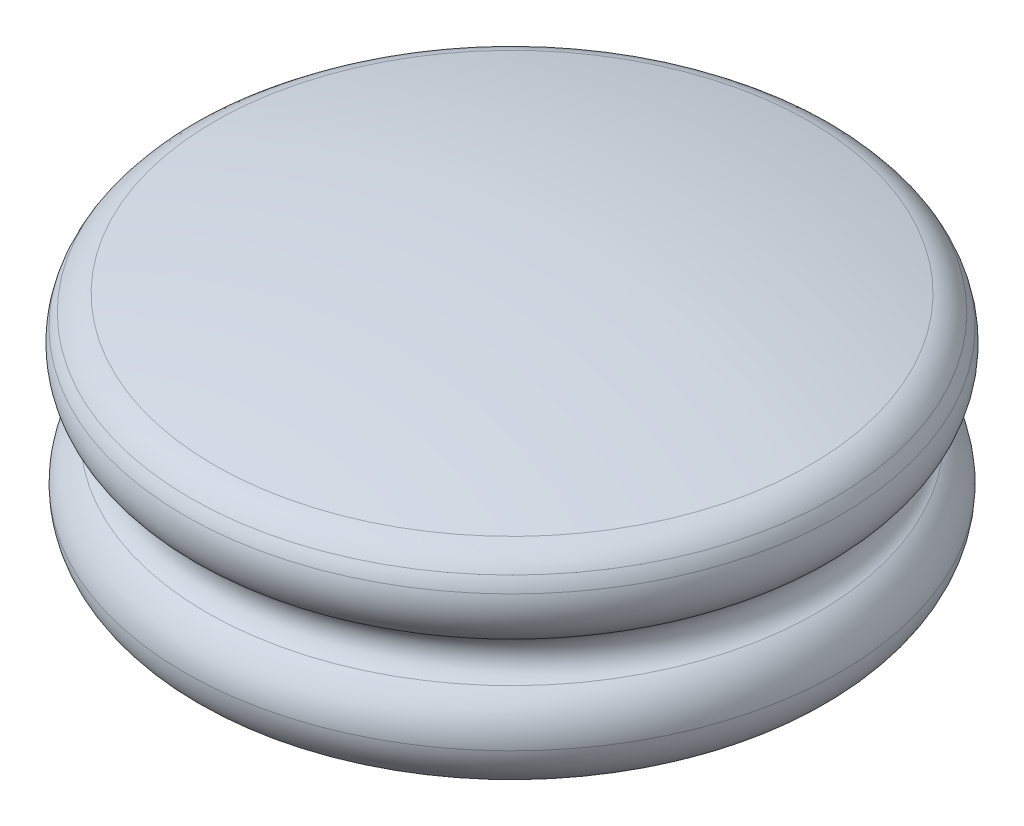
from build123d import *

# Parameters (mm, degrees)
CROQUIS1_R              = 30
SALIENTE_EXTRUIR1_DEPTH = 90
CROQUIS3_W              = 2
CROQUIS3_H              = 3
SALIENTE_EXTRUIR2_DEPTH = 3
CROQUIS13_R             = 35.748821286
CORTAR_EXTRUIR2_DEPTH   = 90


with BuildPart() as part:
    # Croquis1 → Saliente-Extruir1 (new body)
    with BuildSketch(Plane(origin=(0, 0, 0), x_dir=(1, 0, 0), z_dir=(0, 1, 0))):
        with Locations(Location((0, 0, 0), (0, 0, 90))):
            Circle(CROQUIS1_R)
    extrude(amount=SALIENTE_EXTRUIR1_DEPTH)


with BuildPart() as body_2:
    # Croquis3 → Saliente-Extruir2 (new body)
    with BuildSketch(Plane(origin=(0, 90, 0), x_dir=(1, 0, 0), z_dir=(0, 1, 0))):
        with Locations((-30, 0)):
            Rectangle(CROQUIS3_W, CROQUIS3_H)
    extrude(amount=-SALIENTE_EXTRUIR2_DEPTH)


with BuildPart() as body_3:
    # Croquis10 → Revoluci_n4 (revolve)
    with BuildSketch(Plane(origin=(0, 0, 0), x_dir=(0, 0, -1), z_dir=(1, 0, 0)), mode=Mode.PRIVATE) as revoluci_n4_sk:
        with BuildLine():
            Line((0, 119.664534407), (0, 90))
            Line((0, 90), (37.5, 90))
            ThreePointArc((37.5, 90), (39.479834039, 92.165596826), (40.23859032, 94.999999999))
            ThreePointArc((40.23859032, 94.999999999), (39.483319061, 97.836311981), (37.5, 100))
            ThreePointArc((37.5, 100), (35.999559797, 102.5), (37.5, 105))
            ThreePointArc((37.5, 105), (40.077733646, 107.853429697), (40.23859032, 111.695420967))
            ThreePointArc((40.23859032, 111.695420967), (39.930773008, 112.470472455), (39.512783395, 113.192096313))
            ThreePointArc((39.512783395, 113.192096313), (38.23304079, 114.482513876), (36.576607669, 115.230275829))
            ThreePointArc((36.576607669, 115.230275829), (18.422207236, 118.551926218), (0, 119.664534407))
        make_face()
    revolve(revoluci_n4_sk.sketch.rotate(Axis((0, 119.664534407, 0), (0, -1, 0)), 180), axis=Axis((0, 119.664534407, 0), (0, -1, 0)))


with BuildPart() as cortar_extruir2_tool:
    # Croquis13 → Cortar-Extruir2 (new body)
    with BuildSketch(Plane.XZ):
        Circle(CROQUIS13_R)
    extrude(amount=-CORTAR_EXTRUIR2_DEPTH)


with BuildPart() as part_1:
    add(part.part)

    # Cortar-Extruir2: cut by cortar_extruir2_tool
    add(cortar_extruir2_tool.part, mode=Mode.SUBTRACT)


with BuildPart() as body_2_1:
    add(body_2.part)

    # Cortar-Extruir2: cut by cortar_extruir2_tool
    add(cortar_extruir2_tool.part, mode=Mode.SUBTRACT)


solid = body_3.part
